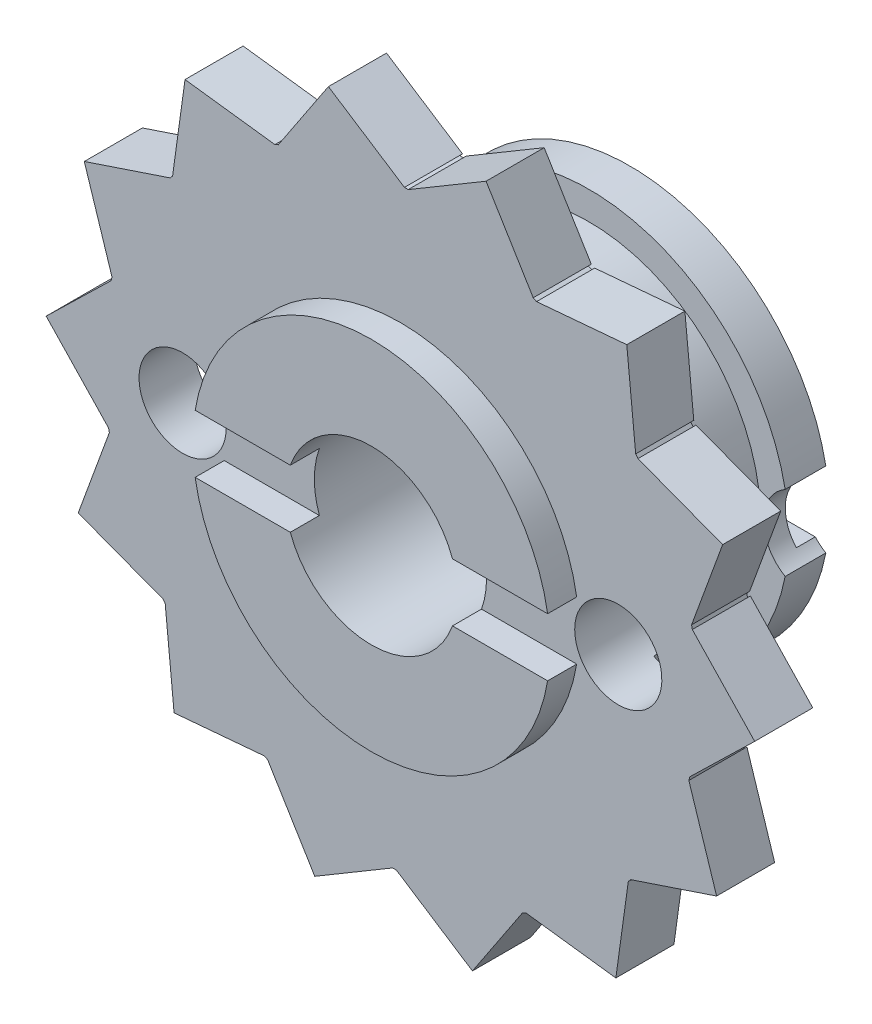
from build123d import *

# Parameters (mm, degrees)
ESQUISSE1_R                   = 10.25
EXTRUSION1_DEPTH              = 8.9
ENL_V_START                   = -1
ESQUISSE2_R                   = 10.25
ENL_V_MAT_EXTRU_2_DEPTH       = 1
ESQUISSE4_R                   = 12.2
EXTRUSION2_DEPTH              = 2
ESQUISSE3_R                   = 2.965
ENL_V_MAT_EXTRU_3_DEPTH       = 20.413654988
ENL_V_MAT_EXTRU_4_DEPTH       = 10
ESQUISSE7_R                   = 10.25
ESQUISSE7_R_2                 = 6.87
ENL_V_MAT_EXTRU_5_DEPTH       = 1.4
ESQUISSE8_R                   = 10.25
ESQUISSE8_R_2                 = 5.9
ENL_V_MAT_EXTRU_7_DEPTH       = 3.15
ESQUISSE9_R                   = 10.25
ESQUISSE9_R_2                 = 6.95
ENL_V_MAT_EXTRU_8_DEPTH       = 1.45
ENL_V_MAT_EXTRU_10_DEPTH      = 0.65
ENL_V_MAT_EXTRU_11_DEPTH      = 20.253178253
ENL_V_MAT_EXTRU_11_DEPTH_BACK = 20.253178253
ESQUISSE12_R                  = 1.15
ESQUISSE13_R                  = 1.5
ENL_V_MAT_EXTRU_12_DEPTH      = 10


with BuildPart() as part:
    # Esquisse1 → Extrusion1 (new body)
    with BuildSketch(Plane.XY):
        Circle(ESQUISSE1_R)
    extrude(amount=EXTRUSION1_DEPTH)

    # Esquisse2 → Enl_v. mat.-Extru.2 (cut)
    with BuildSketch(Plane.XY.offset(8.9).offset(ENL_V_START)):
        Circle(ESQUISSE2_R)
        with BuildLine():
            Line((-2.785964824, 1), (-6.068154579, 1))
            ThreePointArc((-6.068154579, 1), (0, 6.15), (6.068154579, 1))
            Line((6.068154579, 1), (2.785964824, 1))
            ThreePointArc((2.785964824, 1), (2.96, 0), (2.785964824, -1))
            Line((2.785964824, -1), (6.068154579, -1))
            ThreePointArc((6.068154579, -1), (0, -6.15), (-6.068154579, -1))
            Line((-6.068154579, -1), (-2.785964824, -1))
            ThreePointArc((-2.785964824, -1), (-2.96, 0), (-2.785964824, 1))
        make_face(mode=Mode.SUBTRACT)
    extrude(amount=ENL_V_MAT_EXTRU_2_DEPTH, mode=Mode.SUBTRACT)

    # Esquisse4 → Extrusion2 (add)
    with BuildSketch(Plane.XY.offset(7.9)):
        Circle(ESQUISSE4_R)
    extrude(amount=-EXTRUSION2_DEPTH)

    # Esquisse3 → Enl_v. mat.-Extru.3 (cut, through all)
    with BuildSketch(Plane.XY.offset(8.9)):
        Circle(ESQUISSE3_R)
    extrude(amount=-ENL_V_MAT_EXTRU_3_DEPTH, mode=Mode.SUBTRACT)

    # Esquisse6 → Enl_v. mat.-Extru.4 (cut)
    with BuildSketch(Plane(origin=(0, 0, 5.9), x_dir=(-1, 0, 0), z_dir=(0, 0, -1))):
        with BuildLine():
            ThreePointArc((2.479329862, 11.945414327), (-0.240936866, 12.197620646), (-2.949122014, 11.838187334))
            Line((-2.949122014, 11.838187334), (-0.266565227, 10.246533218))
            ThreePointArc((-0.266565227, 10.246533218), (-0.202426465, 10.248000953), (-0.138279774, 10.249067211))
            Line((-0.138279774, 10.249067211), (2.479329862, 11.945414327))
        make_face()
        with BuildLine():
            ThreePointArc((7.416720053, 9.686705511), (5.075272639, 11.094215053), (2.479329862, 11.945414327))
            Line((2.479329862, 11.945414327), (4.205637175, 9.34746575))
            ThreePointArc((4.205637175, 9.34746575), (4.264061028, 9.320959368), (4.322317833, 9.294087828))
            Line((4.322317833, 9.294087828), (7.416720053, 9.686705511))
        make_face()
        with BuildLine():
            Line((-4.571489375, 9.174093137), (-2.949122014, 11.838187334))
            ThreePointArc((-2.949122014, 11.838187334), (-5.50942587, 10.885137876), (-7.793464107, 9.386262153))
            Line((-7.793464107, 9.386262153), (-4.685971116, 9.116149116))
            ThreePointArc((-4.685971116, 9.116149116), (-4.628820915, 9.145300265), (-4.571489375, 9.174093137))
        make_face()
        with BuildLine():
            ThreePointArc((10.885137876, 5.50942587), (9.386262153, 7.793464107), (7.416720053, 9.686705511))
            Line((7.416720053, 9.686705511), (7.844861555, 6.597018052))
            ThreePointArc((7.844861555, 6.597018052), (7.88599894, 6.547787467), (7.926827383, 6.498300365))
            Line((7.926827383, 6.498300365), (10.885137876, 5.50942587))
        make_face()
        with BuildLine():
            Line((-8.099259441, 6.282077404), (-7.793464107, 9.386262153))
            ThreePointArc((-7.793464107, 9.386262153), (-9.686705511, 7.416720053), (-11.094215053, 5.075272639))
            Line((-11.094215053, 5.075272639), (-8.177262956, 6.180199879))
            ThreePointArc((-8.177262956, 6.180199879), (-8.138420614, 6.2312607), (-8.099259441, 6.282077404))
        make_face()
        with BuildLine():
            ThreePointArc((12.197620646, 0.240936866), (11.838187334, 2.949122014), (10.885137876, 5.50942587))
            Line((10.885137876, 5.50942587), (9.930314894, 2.539950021))
            ThreePointArc((9.930314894, 2.539950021), (9.946018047, 2.477745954), (9.961331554, 2.415444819))
            Line((9.961331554, 2.415444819), (12.197620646, 0.240936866))
        make_face()
        with BuildLine():
            Line((-10.022871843, 2.145819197), (-11.094215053, 5.075272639))
            ThreePointArc((-11.094215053, 5.075272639), (-11.945414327, 2.479329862), (-12.197620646, -0.240936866))
            Line((-12.197620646, -0.240936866), (-10.04894758, 2.020186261))
            ThreePointArc((-10.04894758, 2.020186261), (-10.036106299, 2.083043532), (-10.022871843, 2.145819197))
        make_face()
        with BuildLine():
            ThreePointArc((11.094215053, -5.075272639), (11.945414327, -2.479329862), (12.197620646, 0.240936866))
            Line((12.197620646, 0.240936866), (10.04894758, -2.020186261))
            ThreePointArc((10.04894758, -2.020186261), (10.036106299, -2.083043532), (10.022871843, -2.145819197))
            Line((10.022871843, -2.145819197), (11.094215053, -5.075272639))
        make_face()
        with BuildLine():
            Line((-9.961331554, -2.415444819), (-12.197620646, -0.240936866))
            ThreePointArc((-12.197620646, -0.240936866), (-11.838187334, -2.949122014), (-10.885137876, -5.50942587))
            Line((-10.885137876, -5.50942587), (-9.930314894, -2.539950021))
            ThreePointArc((-9.930314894, -2.539950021), (-9.946018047, -2.477745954), (-9.961331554, -2.415444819))
        make_face()
        with BuildLine():
            ThreePointArc((7.793464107, -9.386262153), (9.686705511, -7.416720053), (11.094215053, -5.075272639))
            Line((11.094215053, -5.075272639), (8.177262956, -6.180199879))
            ThreePointArc((8.177262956, -6.180199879), (8.138420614, -6.2312607), (8.099259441, -6.282077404))
            Line((8.099259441, -6.282077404), (7.793464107, -9.386262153))
        make_face()
        with BuildLine():
            Line((-7.926827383, -6.498300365), (-10.885137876, -5.50942587))
            ThreePointArc((-10.885137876, -5.50942587), (-9.386262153, -7.793464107), (-7.416720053, -9.686705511))
            Line((-7.416720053, -9.686705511), (-7.844861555, -6.597018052))
            ThreePointArc((-7.844861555, -6.597018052), (-7.88599894, -6.547787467), (-7.926827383, -6.498300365))
        make_face()
        with BuildLine():
            ThreePointArc((2.949122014, -11.838187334), (5.50942587, -10.885137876), (7.793464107, -9.386262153))
            Line((7.793464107, -9.386262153), (4.685971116, -9.116149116))
            ThreePointArc((4.685971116, -9.116149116), (4.628820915, -9.145300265), (4.571489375, -9.174093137))
            Line((4.571489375, -9.174093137), (2.949122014, -11.838187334))
        make_face()
        with BuildLine():
            Line((-4.322317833, -9.294087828), (-7.416720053, -9.686705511))
            ThreePointArc((-7.416720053, -9.686705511), (-5.075272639, -11.094215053), (-2.479329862, -11.945414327))
            Line((-2.479329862, -11.945414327), (-4.205637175, -9.34746575))
            ThreePointArc((-4.205637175, -9.34746575), (-4.264061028, -9.320959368), (-4.322317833, -9.294087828))
        make_face()
        with BuildLine():
            ThreePointArc((-2.479329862, -11.945414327), (0.240936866, -12.197620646), (2.949122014, -11.838187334))
            Line((2.949122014, -11.838187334), (0.266565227, -10.246533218))
            ThreePointArc((0.266565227, -10.246533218), (0.202426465, -10.248000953), (0.138279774, -10.249067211))
            Line((0.138279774, -10.249067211), (-2.479329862, -11.945414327))
        make_face()
    extrude(amount=-ENL_V_MAT_EXTRU_4_DEPTH, mode=Mode.SUBTRACT)

    # Esquisse7 → Enl_v. mat.-Extru.5 (cut)
    with BuildSketch(Plane(origin=(0, 0, 0), x_dir=(-1, 0, 0), z_dir=(0, 0, -1))):
        Circle(ESQUISSE7_R)
        Circle(ESQUISSE7_R_2, mode=Mode.SUBTRACT)
    extrude(amount=-ENL_V_MAT_EXTRU_5_DEPTH, mode=Mode.SUBTRACT)

    # Esquisse8 → Enl_v. mat.-Extru.7 (cut)
    with BuildSketch(Plane(origin=(0, 0, 1.4), x_dir=(-1, 0, 0), z_dir=(0, 0, -1))):
        Circle(ESQUISSE8_R)
        Circle(ESQUISSE8_R_2, mode=Mode.SUBTRACT)
    extrude(amount=-ENL_V_MAT_EXTRU_7_DEPTH, mode=Mode.SUBTRACT)

    # Esquisse9 → Enl_v. mat.-Extru.8 (cut)
    with BuildSketch(Plane(origin=(0, 0, 4.55), x_dir=(-1, 0, 0), z_dir=(0, 0, -1))):
        Circle(ESQUISSE9_R)
        Circle(ESQUISSE9_R_2, mode=Mode.SUBTRACT)
    extrude(amount=-ENL_V_MAT_EXTRU_8_DEPTH, mode=Mode.SUBTRACT)

    # Esquisse10 → Enl_v. mat.-Extru.10 (cut)
    with BuildSketch(Plane(origin=(0, 0, 0), x_dir=(-1, 0, 0), z_dir=(0, 0, -1))):
        with BuildLine():
            ThreePointArc((2.79127659, 1), (2.965, 0), (2.79127659, -1))
            Line((2.79127659, -1), (6.796830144, -1))
            ThreePointArc((6.796830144, -1), (6.87, 0), (6.796830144, 1))
            Line((6.796830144, 1), (2.79127659, 1))
        make_face()
        with BuildLine():
            ThreePointArc((-2.79127659, -1), (-2.965, 0), (-2.79127659, 1))
            Line((-2.79127659, 1), (-6.796830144, 1))
            ThreePointArc((-6.796830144, 1), (-6.87, 0), (-6.796830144, -1))
            Line((-6.796830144, -1), (-2.79127659, -1))
        make_face()
    extrude(amount=-ENL_V_MAT_EXTRU_10_DEPTH, mode=Mode.SUBTRACT)

    # Esquisse12 → Enl_v. mat.-Extru.11 (cut, two sides: drawn at the far end of the back side and taken through both)
    with BuildSketch(Plane(origin=(0, 0, 0), x_dir=(0, 0, -1), z_dir=(1, 0, 0)).offset(-ENL_V_MAT_EXTRU_11_DEPTH_BACK)):
        with Locations((-2.975, 0)):
            Circle(ESQUISSE12_R)
    extrude(amount=ENL_V_MAT_EXTRU_11_DEPTH + ENL_V_MAT_EXTRU_11_DEPTH_BACK, mode=Mode.SUBTRACT)

    # Esquisse13 → Enl_v. mat.-Extru.12 (cut)
    with BuildSketch(Plane.XY.offset(7.9)):
        with Locations((-7.5, 0)):
            Circle(ESQUISSE13_R)
        with Locations(Location((7.5, 0, 0), (0, 0, 116.950607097))):
            Circle(ESQUISSE13_R)
    extrude(amount=-ENL_V_MAT_EXTRU_12_DEPTH, mode=Mode.SUBTRACT)


solid = part.part
